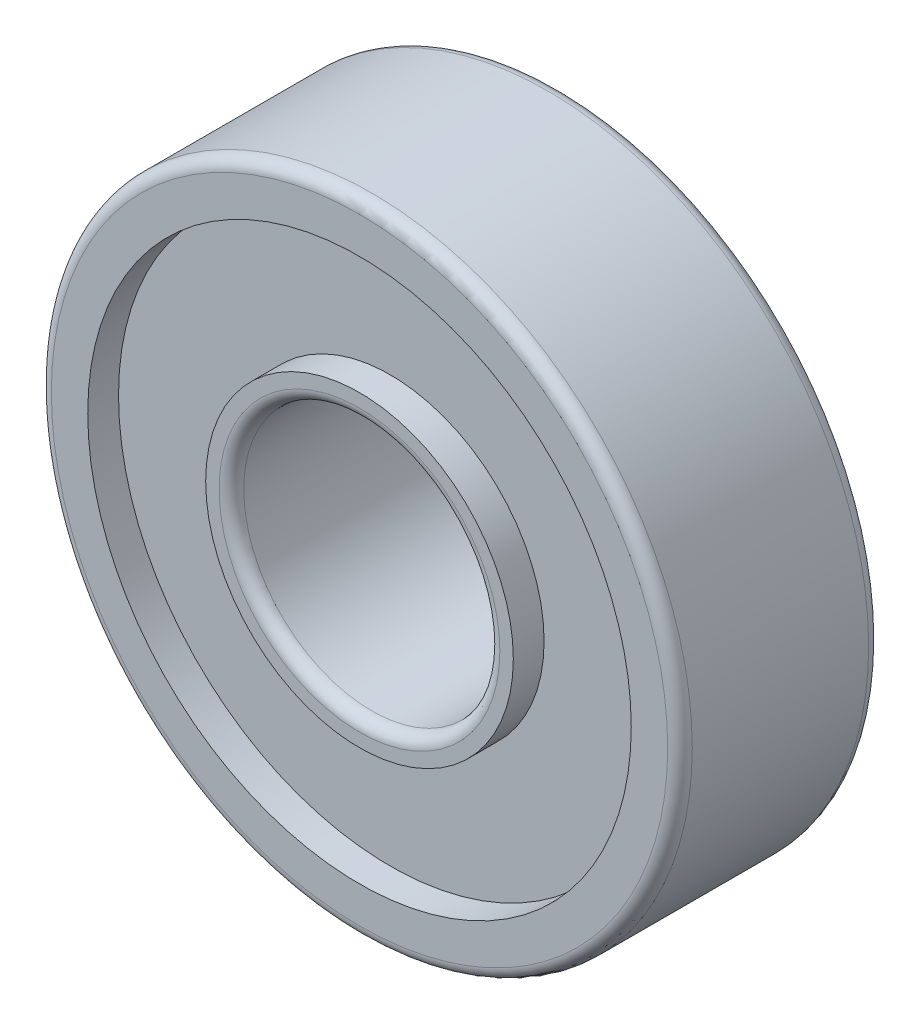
ISO-10303-21;
HEADER;
FILE_DESCRIPTION(('STEP AP214'),'2;1');
FILE_NAME('part.step','',(''),(''),'','','');
FILE_SCHEMA(('AUTOMOTIVE_DESIGN { 1 0 10303 214 1 1 1 1 }'));
ENDSEC;
DATA;
#1=APPLICATION_CONTEXT('core data for automotive mechanical design processes');
#2=APPLICATION_PROTOCOL_DEFINITION('international standard','automotive_design',2000,#1);
#3=PRODUCT_CONTEXT('',#1,'mechanical');
#4=PRODUCT('Part','Part','',(#3));
#5=PRODUCT_RELATED_PRODUCT_CATEGORY('part','',(#4));
#6=PRODUCT_DEFINITION_FORMATION('','',#4);
#7=PRODUCT_DEFINITION_CONTEXT('part definition',#1,'design');
#8=PRODUCT_DEFINITION('design','',#6,#7);
#9=PRODUCT_DEFINITION_SHAPE('','',#8);
#10=(LENGTH_UNIT() NAMED_UNIT(*) SI_UNIT(.MILLI.,.METRE.));
#11=(NAMED_UNIT(*) PLANE_ANGLE_UNIT() SI_UNIT($,.RADIAN.));
#12=(NAMED_UNIT(*) SI_UNIT($,.STERADIAN.) SOLID_ANGLE_UNIT());
#13=UNCERTAINTY_MEASURE_WITH_UNIT(LENGTH_MEASURE(1.E-05),#10,'distance_accuracy_value','');
#14=(GEOMETRIC_REPRESENTATION_CONTEXT(3) GLOBAL_UNCERTAINTY_ASSIGNED_CONTEXT((#13)) GLOBAL_UNIT_ASSIGNED_CONTEXT((#10,
#11,#12)) REPRESENTATION_CONTEXT('',''));
#15=CARTESIAN_POINT('',(0.,0.,0.));
#16=DIRECTION('',(0.,0.,1.));
#17=DIRECTION('',(1.,0.,0.));
#18=AXIS2_PLACEMENT_3D('',#15,#16,#17);
#19=CARTESIAN_POINT('',(0.,0.,-4.9784));
#20=DIRECTION('',(0.,0.,1.));
#21=DIRECTION('',(1.,0.,0.));
#22=AXIS2_PLACEMENT_3D('',#19,#20,#21);
#23=PLANE('',#22);
#24=CARTESIAN_POINT('',(0.,0.,-4.9784));
#25=DIRECTION('',(0.,0.,1.));
#26=DIRECTION('',(1.,0.,0.));
#27=AXIS2_PLACEMENT_3D('',#24,#25,#26);
#28=CIRCLE('',#27,3.47726);
#29=CARTESIAN_POINT('',(3.47726,0.,-4.9784));
#30=VERTEX_POINT('',#29);
#31=EDGE_CURVE('E60',#30,#30,#28,.T.);
#32=ORIENTED_EDGE('',*,*,#31,.T.);
#33=EDGE_LOOP('',(#32));
#34=FACE_BOUND('',#33,.T.);
#35=CARTESIAN_POINT('',(0.,0.,-4.9784));
#36=DIRECTION('',(0.,0.,-1.));
#37=DIRECTION('',(-1.,0.,0.));
#38=AXIS2_PLACEMENT_3D('',#35,#36,#37);
#39=CIRCLE('',#38,3.81);
#40=CARTESIAN_POINT('',(-3.81,0.,-4.9784));
#41=VERTEX_POINT('',#40);
#42=EDGE_CURVE('E82',#41,#41,#39,.T.);
#43=ORIENTED_EDGE('',*,*,#42,.T.);
#44=EDGE_LOOP('',(#43));
#45=FACE_BOUND('',#44,.T.);
#46=ADVANCED_FACE('F31',(#34,#45),#23,.F.);
#47=CARTESIAN_POINT('',(0.,0.,0.));
#48=DIRECTION('',(0.,0.,1.));
#49=DIRECTION('',(1.,0.,0.));
#50=AXIS2_PLACEMENT_3D('',#47,#48,#49);
#51=PLANE('',#50);
#52=CARTESIAN_POINT('',(0.,0.,0.));
#53=DIRECTION('',(0.,0.,1.));
#54=DIRECTION('',(1.,0.,0.));
#55=AXIS2_PLACEMENT_3D('',#52,#53,#54);
#56=CIRCLE('',#55,3.47726);
#57=CARTESIAN_POINT('',(3.47726,0.,0.));
#58=VERTEX_POINT('',#57);
#59=EDGE_CURVE('E51',#58,#58,#56,.F.);
#60=ORIENTED_EDGE('',*,*,#59,.T.);
#61=EDGE_LOOP('',(#60));
#62=FACE_BOUND('',#61,.T.);
#63=CARTESIAN_POINT('',(0.,0.,0.));
#64=DIRECTION('',(0.,0.,1.));
#65=DIRECTION('',(1.,0.,0.));
#66=AXIS2_PLACEMENT_3D('',#63,#64,#65);
#67=CIRCLE('',#66,3.81);
#68=CARTESIAN_POINT('',(3.81,0.,0.));
#69=VERTEX_POINT('',#68);
#70=EDGE_CURVE('E70',#69,#69,#67,.T.);
#71=ORIENTED_EDGE('',*,*,#70,.T.);
#72=EDGE_LOOP('',(#71));
#73=FACE_BOUND('',#72,.T.);
#74=ADVANCED_FACE('F115',(#62,#73),#51,.T.);
#75=CARTESIAN_POINT('',(0.,0.,-4.9784));
#76=DIRECTION('',(0.,0.,1.));
#77=DIRECTION('',(1.,0.,0.));
#78=AXIS2_PLACEMENT_3D('',#75,#76,#77);
#79=CYLINDRICAL_SURFACE('',#78,7.9375);
#80=CARTESIAN_POINT('',(0.,0.,-4.6736));
#81=DIRECTION('',(0.,0.,1.));
#82=DIRECTION('',(1.,0.,0.));
#83=AXIS2_PLACEMENT_3D('',#80,#81,#82);
#84=CIRCLE('',#83,7.9375);
#85=CARTESIAN_POINT('',(7.9375,0.,-4.6736));
#86=VERTEX_POINT('',#85);
#87=EDGE_CURVE('E42',#86,#86,#84,.T.);
#88=ORIENTED_EDGE('',*,*,#87,.T.);
#89=EDGE_LOOP('',(#88));
#90=FACE_BOUND('',#89,.T.);
#91=CARTESIAN_POINT('',(0.,0.,-0.3048));
#92=DIRECTION('',(0.,0.,1.));
#93=DIRECTION('',(1.,0.,0.));
#94=AXIS2_PLACEMENT_3D('',#91,#92,#93);
#95=CIRCLE('',#94,7.9375);
#96=CARTESIAN_POINT('',(7.9375,0.,-0.3048));
#97=VERTEX_POINT('',#96);
#98=EDGE_CURVE('E46',#97,#97,#95,.F.);
#99=ORIENTED_EDGE('',*,*,#98,.T.);
#100=EDGE_LOOP('',(#99));
#101=FACE_BOUND('',#100,.T.);
#102=ADVANCED_FACE('F107',(#90,#101),#79,.T.);
#103=CARTESIAN_POINT('',(0.,0.,-4.9784));
#104=DIRECTION('',(0.,0.,1.));
#105=DIRECTION('',(1.,0.,0.));
#106=AXIS2_PLACEMENT_3D('',#103,#104,#105);
#107=CIRCLE('',#106,7.6327);
#108=CARTESIAN_POINT('',(7.6327,0.,-4.9784));
#109=VERTEX_POINT('',#108);
#110=EDGE_CURVE('E38',#109,#109,#107,.F.);
#111=ORIENTED_EDGE('',*,*,#110,.T.);
#112=EDGE_LOOP('',(#111));
#113=FACE_BOUND('',#112,.T.);
#114=CARTESIAN_POINT('',(0.,0.,-4.9784));
#115=DIRECTION('',(0.,0.,-1.));
#116=DIRECTION('',(-1.,0.,0.));
#117=AXIS2_PLACEMENT_3D('',#114,#115,#116);
#118=CIRCLE('',#117,6.731);
#119=CARTESIAN_POINT('',(-6.731,0.,-4.9784));
#120=VERTEX_POINT('',#119);
#121=EDGE_CURVE('E76',#120,#120,#118,.T.);
#122=ORIENTED_EDGE('',*,*,#121,.F.);
#123=EDGE_LOOP('',(#122));
#124=FACE_BOUND('',#123,.T.);
#125=ADVANCED_FACE('F104',(#113,#124),#23,.F.);
#126=CARTESIAN_POINT('',(0.,0.,0.));
#127=DIRECTION('',(0.,0.,1.));
#128=DIRECTION('',(1.,0.,0.));
#129=AXIS2_PLACEMENT_3D('',#126,#127,#128);
#130=CIRCLE('',#129,7.6327);
#131=CARTESIAN_POINT('',(7.6327,0.,0.));
#132=VERTEX_POINT('',#131);
#133=EDGE_CURVE('E10',#132,#132,#130,.T.);
#134=ORIENTED_EDGE('',*,*,#133,.T.);
#135=EDGE_LOOP('',(#134));
#136=FACE_BOUND('',#135,.T.);
#137=CARTESIAN_POINT('',(0.,0.,0.));
#138=DIRECTION('',(0.,0.,1.));
#139=DIRECTION('',(1.,0.,0.));
#140=AXIS2_PLACEMENT_3D('',#137,#138,#139);
#141=CIRCLE('',#140,6.731);
#142=CARTESIAN_POINT('',(6.731,0.,0.));
#143=VERTEX_POINT('',#142);
#144=EDGE_CURVE('E64',#143,#143,#141,.T.);
#145=ORIENTED_EDGE('',*,*,#144,.F.);
#146=EDGE_LOOP('',(#145));
#147=FACE_BOUND('',#146,.T.);
#148=ADVANCED_FACE('F106',(#136,#147),#51,.T.);
#149=CARTESIAN_POINT('',(0.,0.,-4.9784));
#150=DIRECTION('',(0.,0.,1.));
#151=DIRECTION('',(1.,0.,0.));
#152=AXIS2_PLACEMENT_3D('',#149,#150,#151);
#153=CYLINDRICAL_SURFACE('',#152,3.17246);
#154=CARTESIAN_POINT('',(0.,0.,-4.6736));
#155=DIRECTION('',(0.,0.,1.));
#156=DIRECTION('',(1.,0.,0.));
#157=AXIS2_PLACEMENT_3D('',#154,#155,#156);
#158=CIRCLE('',#157,3.17246);
#159=CARTESIAN_POINT('',(3.17246,0.,-4.6736));
#160=VERTEX_POINT('',#159);
#161=EDGE_CURVE('E54',#160,#160,#158,.F.);
#162=ORIENTED_EDGE('',*,*,#161,.T.);
#163=EDGE_LOOP('',(#162));
#164=FACE_BOUND('',#163,.T.);
#165=CARTESIAN_POINT('',(0.,0.,-0.3048));
#166=DIRECTION('',(0.,0.,1.));
#167=DIRECTION('',(1.,0.,0.));
#168=AXIS2_PLACEMENT_3D('',#165,#166,#167);
#169=CIRCLE('',#168,3.17246);
#170=CARTESIAN_POINT('',(3.17246,0.,-0.3048));
#171=VERTEX_POINT('',#170);
#172=EDGE_CURVE('E57',#171,#171,#169,.T.);
#173=ORIENTED_EDGE('',*,*,#172,.T.);
#174=EDGE_LOOP('',(#173));
#175=FACE_BOUND('',#174,.T.);
#176=ADVANCED_FACE('F113',(#164,#175),#153,.F.);
#177=CARTESIAN_POINT('',(0.,0.,-0.762));
#178=DIRECTION('',(0.,0.,1.));
#179=DIRECTION('',(1.,0.,0.));
#180=AXIS2_PLACEMENT_3D('',#177,#178,#179);
#181=CYLINDRICAL_SURFACE('',#180,6.731);
#182=CARTESIAN_POINT('',(0.,0.,-0.762));
#183=DIRECTION('',(0.,0.,1.));
#184=DIRECTION('',(1.,0.,0.));
#185=AXIS2_PLACEMENT_3D('',#182,#183,#184);
#186=CIRCLE('',#185,6.731);
#187=CARTESIAN_POINT('',(6.731,0.,-0.762));
#188=VERTEX_POINT('',#187);
#189=EDGE_CURVE('E63',#188,#188,#186,.T.);
#190=CARTESIAN_POINT('',(6.731,0.,-0.762));
#191=CARTESIAN_POINT('',(6.731,0.,-0.7540625));
#192=CARTESIAN_POINT('',(6.731,0.,-0.746125));
#193=CARTESIAN_POINT('',(6.731,0.,-0.73025));
#194=CARTESIAN_POINT('',(6.731,0.,-0.7223125));
#195=CARTESIAN_POINT('',(6.731,0.,-0.7064375));
#196=CARTESIAN_POINT('',(6.731,0.,-0.6985));
#197=CARTESIAN_POINT('',(6.731,0.,-0.682625));
#198=CARTESIAN_POINT('',(6.731,0.,-0.6746875));
#199=CARTESIAN_POINT('',(6.731,0.,-0.6588125));
#200=CARTESIAN_POINT('',(6.731,0.,-0.650875));
#201=CARTESIAN_POINT('',(6.731,0.,-0.635));
#202=CARTESIAN_POINT('',(6.731,0.,-0.6270625));
#203=CARTESIAN_POINT('',(6.731,0.,-0.6111875));
#204=CARTESIAN_POINT('',(6.731,0.,-0.60325));
#205=CARTESIAN_POINT('',(6.731,0.,-0.587375));
#206=CARTESIAN_POINT('',(6.731,0.,-0.5794375));
#207=CARTESIAN_POINT('',(6.731,0.,-0.5635625));
#208=CARTESIAN_POINT('',(6.731,0.,-0.555625));
#209=CARTESIAN_POINT('',(6.731,0.,-0.53975));
#210=CARTESIAN_POINT('',(6.731,0.,-0.5318125));
#211=CARTESIAN_POINT('',(6.731,0.,-0.5159375));
#212=CARTESIAN_POINT('',(6.731,0.,-0.508));
#213=CARTESIAN_POINT('',(6.731,0.,-0.492125));
#214=CARTESIAN_POINT('',(6.731,0.,-0.4841875));
#215=CARTESIAN_POINT('',(6.731,0.,-0.4683125));
#216=CARTESIAN_POINT('',(6.731,0.,-0.460375));
#217=CARTESIAN_POINT('',(6.731,0.,-0.4445));
#218=CARTESIAN_POINT('',(6.731,0.,-0.4365625));
#219=CARTESIAN_POINT('',(6.731,0.,-0.4206875));
#220=CARTESIAN_POINT('',(6.731,0.,-0.41275));
#221=CARTESIAN_POINT('',(6.731,0.,-0.396875));
#222=CARTESIAN_POINT('',(6.731,0.,-0.3889375));
#223=CARTESIAN_POINT('',(6.731,0.,-0.3730625));
#224=CARTESIAN_POINT('',(6.731,0.,-0.365125));
#225=CARTESIAN_POINT('',(6.731,0.,-0.34925));
#226=CARTESIAN_POINT('',(6.731,0.,-0.3413125));
#227=CARTESIAN_POINT('',(6.731,0.,-0.3254375));
#228=CARTESIAN_POINT('',(6.731,0.,-0.3175));
#229=CARTESIAN_POINT('',(6.731,0.,-0.301625));
#230=CARTESIAN_POINT('',(6.731,0.,-0.2936875));
#231=CARTESIAN_POINT('',(6.731,0.,-0.2778125));
#232=CARTESIAN_POINT('',(6.731,0.,-0.269875));
#233=CARTESIAN_POINT('',(6.731,0.,-0.254));
#234=CARTESIAN_POINT('',(6.731,0.,-0.2460625));
#235=CARTESIAN_POINT('',(6.731,0.,-0.2301875));
#236=CARTESIAN_POINT('',(6.731,0.,-0.22225));
#237=CARTESIAN_POINT('',(6.731,0.,-0.206375));
#238=CARTESIAN_POINT('',(6.731,0.,-0.1984375));
#239=CARTESIAN_POINT('',(6.731,0.,-0.1825625));
#240=CARTESIAN_POINT('',(6.731,0.,-0.174625));
#241=CARTESIAN_POINT('',(6.731,0.,-0.15875));
#242=CARTESIAN_POINT('',(6.731,0.,-0.1508125));
#243=CARTESIAN_POINT('',(6.731,0.,-0.1349375));
#244=CARTESIAN_POINT('',(6.731,0.,-0.127));
#245=CARTESIAN_POINT('',(6.731,0.,-0.111125));
#246=CARTESIAN_POINT('',(6.731,0.,-0.1031875));
#247=CARTESIAN_POINT('',(6.731,0.,-0.0873125));
#248=CARTESIAN_POINT('',(6.731,0.,-0.079375));
#249=CARTESIAN_POINT('',(6.731,0.,-0.0635));
#250=CARTESIAN_POINT('',(6.731,0.,-0.0555625));
#251=CARTESIAN_POINT('',(6.731,0.,-0.0396875));
#252=CARTESIAN_POINT('',(6.731,0.,-0.03175));
#253=CARTESIAN_POINT('',(6.731,0.,-0.015875));
#254=CARTESIAN_POINT('',(6.731,0.,-0.00793749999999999));
#255=CARTESIAN_POINT('',(6.731,0.,0.));
#256=B_SPLINE_CURVE_WITH_KNOTS('',3,(#190,#191,#192,#193,#194,#195,#196,#197,#198,#199,#200,
#201,#202,#203,#204,#205,#206,#207,#208,#209,#210,#211,#212,#213,#214,#215,#216,#217,#218,#219,
#220,#221,#222,#223,#224,#225,#226,#227,#228,#229,#230,#231,#232,#233,#234,#235,#236,#237,#238,
#239,#240,#241,#242,#243,#244,#245,#246,#247,#248,#249,#250,#251,#252,#253,#254,#255),
.UNSPECIFIED.,.F.,.F.,(4,2,2,2,2,2,2,2,2,2,2,2,2,2,2,2,2,2,2,2,2,2,2,2,2,2,2,2,2,2,2,2,4),(0.,
0.0238125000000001,0.047625,0.0714375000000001,0.0952500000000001,0.1190625,0.142875,0.1666875,
0.1905,0.2143125,0.238125,0.2619375,0.28575,0.3095625,0.333375,0.3571875,0.381,0.4048125,
0.428625,0.4524375,0.47625,0.5000625,0.523875,0.5476875,0.5715,0.5953125,0.619125,0.6429375,
0.66675,0.6905625,0.714375,0.7381875,0.762),.UNSPECIFIED.);
#257=EDGE_CURVE('BSEAM144',#188,#143,#256,.T.);
#258=ORIENTED_EDGE('',*,*,#189,.F.);
#259=ORIENTED_EDGE('',*,*,#144,.T.);
#260=ORIENTED_EDGE('',*,*,#257,.T.);
#261=ORIENTED_EDGE('',*,*,#257,.F.);
#262=EDGE_LOOP('',(#258,#260,#259,#261));
#263=FACE_BOUND('',#262,.T.);
#264=ADVANCED_FACE('F144',(#263),#181,.F.);
#265=CARTESIAN_POINT('',(0.,0.,-0.762));
#266=DIRECTION('',(0.,0.,1.));
#267=DIRECTION('',(1.,0.,0.));
#268=AXIS2_PLACEMENT_3D('',#265,#266,#267);
#269=PLANE('',#268);
#270=CARTESIAN_POINT('',(0.,0.,-0.762));
#271=DIRECTION('',(0.,0.,1.));
#272=DIRECTION('',(1.,0.,0.));
#273=AXIS2_PLACEMENT_3D('',#270,#271,#272);
#274=CIRCLE('',#273,3.81);
#275=CARTESIAN_POINT('',(3.81,0.,-0.762));
#276=VERTEX_POINT('',#275);
#277=EDGE_CURVE('E67',#276,#276,#274,.T.);
#278=ORIENTED_EDGE('',*,*,#277,.F.);
#279=EDGE_LOOP('',(#278));
#280=FACE_BOUND('',#279,.T.);
#281=ORIENTED_EDGE('',*,*,#189,.T.);
#282=EDGE_LOOP('',(#281));
#283=FACE_BOUND('',#282,.T.);
#284=ADVANCED_FACE('F140',(#280,#283),#269,.T.);
#285=CARTESIAN_POINT('',(0.,0.,-0.762));
#286=DIRECTION('',(0.,0.,1.));
#287=DIRECTION('',(1.,0.,0.));
#288=AXIS2_PLACEMENT_3D('',#285,#286,#287);
#289=CYLINDRICAL_SURFACE('',#288,3.81);
#290=CARTESIAN_POINT('',(3.81,0.,-0.762));
#291=CARTESIAN_POINT('',(3.81,0.,-0.7540625));
#292=CARTESIAN_POINT('',(3.81,0.,-0.746125));
#293=CARTESIAN_POINT('',(3.81,0.,-0.73025));
#294=CARTESIAN_POINT('',(3.81,0.,-0.7223125));
#295=CARTESIAN_POINT('',(3.81,0.,-0.7064375));
#296=CARTESIAN_POINT('',(3.81,0.,-0.6985));
#297=CARTESIAN_POINT('',(3.81,0.,-0.682625));
#298=CARTESIAN_POINT('',(3.81,0.,-0.6746875));
#299=CARTESIAN_POINT('',(3.81,0.,-0.6588125));
#300=CARTESIAN_POINT('',(3.81,0.,-0.650875));
#301=CARTESIAN_POINT('',(3.81,0.,-0.635));
#302=CARTESIAN_POINT('',(3.81,0.,-0.6270625));
#303=CARTESIAN_POINT('',(3.81,0.,-0.6111875));
#304=CARTESIAN_POINT('',(3.81,0.,-0.60325));
#305=CARTESIAN_POINT('',(3.81,0.,-0.587375));
#306=CARTESIAN_POINT('',(3.81,0.,-0.5794375));
#307=CARTESIAN_POINT('',(3.81,0.,-0.5635625));
#308=CARTESIAN_POINT('',(3.81,0.,-0.555625));
#309=CARTESIAN_POINT('',(3.81,0.,-0.53975));
#310=CARTESIAN_POINT('',(3.81,0.,-0.5318125));
#311=CARTESIAN_POINT('',(3.81,0.,-0.5159375));
#312=CARTESIAN_POINT('',(3.81,0.,-0.508));
#313=CARTESIAN_POINT('',(3.81,0.,-0.492125));
#314=CARTESIAN_POINT('',(3.81,0.,-0.4841875));
#315=CARTESIAN_POINT('',(3.81,0.,-0.4683125));
#316=CARTESIAN_POINT('',(3.81,0.,-0.460375));
#317=CARTESIAN_POINT('',(3.81,0.,-0.4445));
#318=CARTESIAN_POINT('',(3.81,0.,-0.4365625));
#319=CARTESIAN_POINT('',(3.81,0.,-0.4206875));
#320=CARTESIAN_POINT('',(3.81,0.,-0.41275));
#321=CARTESIAN_POINT('',(3.81,0.,-0.396875));
#322=CARTESIAN_POINT('',(3.81,0.,-0.3889375));
#323=CARTESIAN_POINT('',(3.81,0.,-0.3730625));
#324=CARTESIAN_POINT('',(3.81,0.,-0.365125));
#325=CARTESIAN_POINT('',(3.81,0.,-0.34925));
#326=CARTESIAN_POINT('',(3.81,0.,-0.3413125));
#327=CARTESIAN_POINT('',(3.81,0.,-0.3254375));
#328=CARTESIAN_POINT('',(3.81,0.,-0.3175));
#329=CARTESIAN_POINT('',(3.81,0.,-0.301625));
#330=CARTESIAN_POINT('',(3.81,0.,-0.2936875));
#331=CARTESIAN_POINT('',(3.81,0.,-0.2778125));
#332=CARTESIAN_POINT('',(3.81,0.,-0.269875));
#333=CARTESIAN_POINT('',(3.81,0.,-0.254));
#334=CARTESIAN_POINT('',(3.81,0.,-0.2460625));
#335=CARTESIAN_POINT('',(3.81,0.,-0.2301875));
#336=CARTESIAN_POINT('',(3.81,0.,-0.22225));
#337=CARTESIAN_POINT('',(3.81,0.,-0.206375));
#338=CARTESIAN_POINT('',(3.81,0.,-0.1984375));
#339=CARTESIAN_POINT('',(3.81,0.,-0.1825625));
#340=CARTESIAN_POINT('',(3.81,0.,-0.174625));
#341=CARTESIAN_POINT('',(3.81,0.,-0.15875));
#342=CARTESIAN_POINT('',(3.81,0.,-0.1508125));
#343=CARTESIAN_POINT('',(3.81,0.,-0.1349375));
#344=CARTESIAN_POINT('',(3.81,0.,-0.127));
#345=CARTESIAN_POINT('',(3.81,0.,-0.111125));
#346=CARTESIAN_POINT('',(3.81,0.,-0.1031875));
#347=CARTESIAN_POINT('',(3.81,0.,-0.0873125));
#348=CARTESIAN_POINT('',(3.81,0.,-0.079375));
#349=CARTESIAN_POINT('',(3.81,0.,-0.0635));
#350=CARTESIAN_POINT('',(3.81,0.,-0.0555625));
#351=CARTESIAN_POINT('',(3.81,0.,-0.0396875));
#352=CARTESIAN_POINT('',(3.81,0.,-0.03175));
#353=CARTESIAN_POINT('',(3.81,0.,-0.015875));
#354=CARTESIAN_POINT('',(3.81,0.,-0.00793749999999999));
#355=CARTESIAN_POINT('',(3.81,0.,0.));
#356=B_SPLINE_CURVE_WITH_KNOTS('',3,(#290,#291,#292,#293,#294,#295,#296,#297,#298,#299,#300,
#301,#302,#303,#304,#305,#306,#307,#308,#309,#310,#311,#312,#313,#314,#315,#316,#317,#318,#319,
#320,#321,#322,#323,#324,#325,#326,#327,#328,#329,#330,#331,#332,#333,#334,#335,#336,#337,#338,
#339,#340,#341,#342,#343,#344,#345,#346,#347,#348,#349,#350,#351,#352,#353,#354,#355),
.UNSPECIFIED.,.F.,.F.,(4,2,2,2,2,2,2,2,2,2,2,2,2,2,2,2,2,2,2,2,2,2,2,2,2,2,2,2,2,2,2,2,4),(0.,
0.0238125,0.0476249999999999,0.0714375,0.09525,0.1190625,0.142875,0.1666875,0.1905,0.2143125,
0.238125,0.2619375,0.28575,0.3095625,0.333375,0.3571875,0.381,0.4048125,0.428625,0.4524375,
0.47625,0.5000625,0.523875,0.5476875,0.5715,0.5953125,0.619125,0.6429375,0.66675,0.6905625,
0.714375,0.7381875,0.762),.UNSPECIFIED.);
#357=EDGE_CURVE('BSEAM100',#276,#69,#356,.T.);
#358=ORIENTED_EDGE('',*,*,#277,.T.);
#359=ORIENTED_EDGE('',*,*,#70,.F.);
#360=ORIENTED_EDGE('',*,*,#357,.T.);
#361=ORIENTED_EDGE('',*,*,#357,.F.);
#362=EDGE_LOOP('',(#358,#360,#359,#361));
#363=FACE_BOUND('',#362,.T.);
#364=ADVANCED_FACE('F100',(#363),#289,.T.);
#365=CARTESIAN_POINT('',(0.,0.,-4.2164));
#366=DIRECTION('',(0.,0.,-1.));
#367=DIRECTION('',(-1.,0.,0.));
#368=AXIS2_PLACEMENT_3D('',#365,#366,#367);
#369=CYLINDRICAL_SURFACE('',#368,6.731);
#370=CARTESIAN_POINT('',(0.,0.,-4.2164));
#371=DIRECTION('',(0.,0.,-1.));
#372=DIRECTION('',(-1.,0.,0.));
#373=AXIS2_PLACEMENT_3D('',#370,#371,#372);
#374=CIRCLE('',#373,6.731);
#375=CARTESIAN_POINT('',(-6.731,0.,-4.2164));
#376=VERTEX_POINT('',#375);
#377=EDGE_CURVE('E73',#376,#376,#374,.T.);
#378=CARTESIAN_POINT('',(-6.731,0.,-4.2164));
#379=CARTESIAN_POINT('',(-6.731,0.,-4.2243375));
#380=CARTESIAN_POINT('',(-6.731,0.,-4.232275));
#381=CARTESIAN_POINT('',(-6.731,0.,-4.24815));
#382=CARTESIAN_POINT('',(-6.731,0.,-4.2560875));
#383=CARTESIAN_POINT('',(-6.731,0.,-4.2719625));
#384=CARTESIAN_POINT('',(-6.731,0.,-4.2799));
#385=CARTESIAN_POINT('',(-6.731,0.,-4.295775));
#386=CARTESIAN_POINT('',(-6.731,0.,-4.3037125));
#387=CARTESIAN_POINT('',(-6.731,0.,-4.3195875));
#388=CARTESIAN_POINT('',(-6.731,0.,-4.327525));
#389=CARTESIAN_POINT('',(-6.731,0.,-4.3434));
#390=CARTESIAN_POINT('',(-6.731,0.,-4.3513375));
#391=CARTESIAN_POINT('',(-6.731,0.,-4.3672125));
#392=CARTESIAN_POINT('',(-6.731,0.,-4.37515));
#393=CARTESIAN_POINT('',(-6.731,0.,-4.391025));
#394=CARTESIAN_POINT('',(-6.731,0.,-4.3989625));
#395=CARTESIAN_POINT('',(-6.731,0.,-4.4148375));
#396=CARTESIAN_POINT('',(-6.731,0.,-4.422775));
#397=CARTESIAN_POINT('',(-6.731,0.,-4.43865));
#398=CARTESIAN_POINT('',(-6.731,0.,-4.4465875));
#399=CARTESIAN_POINT('',(-6.731,0.,-4.4624625));
#400=CARTESIAN_POINT('',(-6.731,0.,-4.4704));
#401=CARTESIAN_POINT('',(-6.731,0.,-4.486275));
#402=CARTESIAN_POINT('',(-6.731,0.,-4.4942125));
#403=CARTESIAN_POINT('',(-6.731,0.,-4.5100875));
#404=CARTESIAN_POINT('',(-6.731,0.,-4.518025));
#405=CARTESIAN_POINT('',(-6.731,0.,-4.5339));
#406=CARTESIAN_POINT('',(-6.731,0.,-4.5418375));
#407=CARTESIAN_POINT('',(-6.731,0.,-4.5577125));
#408=CARTESIAN_POINT('',(-6.731,0.,-4.56565));
#409=CARTESIAN_POINT('',(-6.731,0.,-4.581525));
#410=CARTESIAN_POINT('',(-6.731,0.,-4.5894625));
#411=CARTESIAN_POINT('',(-6.731,0.,-4.6053375));
#412=CARTESIAN_POINT('',(-6.731,0.,-4.613275));
#413=CARTESIAN_POINT('',(-6.731,0.,-4.62915));
#414=CARTESIAN_POINT('',(-6.731,0.,-4.6370875));
#415=CARTESIAN_POINT('',(-6.731,0.,-4.6529625));
#416=CARTESIAN_POINT('',(-6.731,0.,-4.6609));
#417=CARTESIAN_POINT('',(-6.731,0.,-4.676775));
#418=CARTESIAN_POINT('',(-6.731,0.,-4.6847125));
#419=CARTESIAN_POINT('',(-6.731,0.,-4.7005875));
#420=CARTESIAN_POINT('',(-6.731,0.,-4.708525));
#421=CARTESIAN_POINT('',(-6.731,0.,-4.7244));
#422=CARTESIAN_POINT('',(-6.731,0.,-4.7323375));
#423=CARTESIAN_POINT('',(-6.731,0.,-4.7482125));
#424=CARTESIAN_POINT('',(-6.731,0.,-4.75615));
#425=CARTESIAN_POINT('',(-6.731,0.,-4.772025));
#426=CARTESIAN_POINT('',(-6.731,0.,-4.7799625));
#427=CARTESIAN_POINT('',(-6.731,0.,-4.7958375));
#428=CARTESIAN_POINT('',(-6.731,0.,-4.803775));
#429=CARTESIAN_POINT('',(-6.731,0.,-4.81965));
#430=CARTESIAN_POINT('',(-6.731,0.,-4.8275875));
#431=CARTESIAN_POINT('',(-6.731,0.,-4.8434625));
#432=CARTESIAN_POINT('',(-6.731,0.,-4.8514));
#433=CARTESIAN_POINT('',(-6.731,0.,-4.867275));
#434=CARTESIAN_POINT('',(-6.731,0.,-4.8752125));
#435=CARTESIAN_POINT('',(-6.731,0.,-4.8910875));
#436=CARTESIAN_POINT('',(-6.731,0.,-4.899025));
#437=CARTESIAN_POINT('',(-6.731,0.,-4.9149));
#438=CARTESIAN_POINT('',(-6.731,0.,-4.9228375));
#439=CARTESIAN_POINT('',(-6.731,0.,-4.9387125));
#440=CARTESIAN_POINT('',(-6.731,0.,-4.94665));
#441=CARTESIAN_POINT('',(-6.731,0.,-4.962525));
#442=CARTESIAN_POINT('',(-6.731,0.,-4.9704625));
#443=CARTESIAN_POINT('',(-6.731,0.,-4.9784));
#444=B_SPLINE_CURVE_WITH_KNOTS('',3,(#378,#379,#380,#381,#382,#383,#384,#385,#386,#387,#388,
#389,#390,#391,#392,#393,#394,#395,#396,#397,#398,#399,#400,#401,#402,#403,#404,#405,#406,#407,
#408,#409,#410,#411,#412,#413,#414,#415,#416,#417,#418,#419,#420,#421,#422,#423,#424,#425,#426,
#427,#428,#429,#430,#431,#432,#433,#434,#435,#436,#437,#438,#439,#440,#441,#442,#443),
.UNSPECIFIED.,.F.,.F.,(4,2,2,2,2,2,2,2,2,2,2,2,2,2,2,2,2,2,2,2,2,2,2,2,2,2,2,2,2,2,2,2,4),(0.,
0.0238124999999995,0.0476249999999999,0.0714374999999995,0.0952499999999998,0.119062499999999,
0.142875,0.166687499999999,0.1905,0.214312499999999,0.238125,0.261937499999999,0.28575,
0.309562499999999,0.333374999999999,0.3571875,0.380999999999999,0.4048125,0.428624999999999,
0.4524375,0.476249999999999,0.5000625,0.523874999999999,0.5476875,0.571499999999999,
0.595312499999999,0.619124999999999,0.642937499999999,0.666749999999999,0.690562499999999,
0.714375,0.738187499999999,0.762),.UNSPECIFIED.);
#445=EDGE_CURVE('BSEAM94',#376,#120,#444,.T.);
#446=ORIENTED_EDGE('',*,*,#377,.F.);
#447=ORIENTED_EDGE('',*,*,#121,.T.);
#448=ORIENTED_EDGE('',*,*,#445,.T.);
#449=ORIENTED_EDGE('',*,*,#445,.F.);
#450=EDGE_LOOP('',(#446,#448,#447,#449));
#451=FACE_BOUND('',#450,.T.);
#452=ADVANCED_FACE('F94',(#451),#369,.F.);
#453=CARTESIAN_POINT('',(0.,0.,-4.2164));
#454=DIRECTION('',(0.,0.,-1.));
#455=DIRECTION('',(-1.,0.,0.));
#456=AXIS2_PLACEMENT_3D('',#453,#454,#455);
#457=PLANE('',#456);
#458=CARTESIAN_POINT('',(0.,0.,-4.2164));
#459=DIRECTION('',(0.,0.,-1.));
#460=DIRECTION('',(-1.,0.,0.));
#461=AXIS2_PLACEMENT_3D('',#458,#459,#460);
#462=CIRCLE('',#461,3.81);
#463=CARTESIAN_POINT('',(-3.81,0.,-4.2164));
#464=VERTEX_POINT('',#463);
#465=EDGE_CURVE('E79',#464,#464,#462,.T.);
#466=ORIENTED_EDGE('',*,*,#465,.F.);
#467=EDGE_LOOP('',(#466));
#468=FACE_BOUND('',#467,.T.);
#469=ORIENTED_EDGE('',*,*,#377,.T.);
#470=EDGE_LOOP('',(#469));
#471=FACE_BOUND('',#470,.T.);
#472=ADVANCED_FACE('F91',(#468,#471),#457,.T.);
#473=CARTESIAN_POINT('',(0.,0.,-4.2164));
#474=DIRECTION('',(0.,0.,-1.));
#475=DIRECTION('',(-1.,0.,0.));
#476=AXIS2_PLACEMENT_3D('',#473,#474,#475);
#477=CYLINDRICAL_SURFACE('',#476,3.81);
#478=CARTESIAN_POINT('',(-3.81,0.,-4.2164));
#479=CARTESIAN_POINT('',(-3.81,0.,-4.2243375));
#480=CARTESIAN_POINT('',(-3.81,0.,-4.232275));
#481=CARTESIAN_POINT('',(-3.81,0.,-4.24815));
#482=CARTESIAN_POINT('',(-3.81,0.,-4.2560875));
#483=CARTESIAN_POINT('',(-3.81,0.,-4.2719625));
#484=CARTESIAN_POINT('',(-3.81,0.,-4.2799));
#485=CARTESIAN_POINT('',(-3.81,0.,-4.295775));
#486=CARTESIAN_POINT('',(-3.81,0.,-4.3037125));
#487=CARTESIAN_POINT('',(-3.81,0.,-4.3195875));
#488=CARTESIAN_POINT('',(-3.81,0.,-4.327525));
#489=CARTESIAN_POINT('',(-3.81,0.,-4.3434));
#490=CARTESIAN_POINT('',(-3.81,0.,-4.3513375));
#491=CARTESIAN_POINT('',(-3.81,0.,-4.3672125));
#492=CARTESIAN_POINT('',(-3.81,0.,-4.37515));
#493=CARTESIAN_POINT('',(-3.81,0.,-4.391025));
#494=CARTESIAN_POINT('',(-3.81,0.,-4.3989625));
#495=CARTESIAN_POINT('',(-3.81,0.,-4.4148375));
#496=CARTESIAN_POINT('',(-3.81,0.,-4.422775));
#497=CARTESIAN_POINT('',(-3.81,0.,-4.43865));
#498=CARTESIAN_POINT('',(-3.81,0.,-4.4465875));
#499=CARTESIAN_POINT('',(-3.81,0.,-4.4624625));
#500=CARTESIAN_POINT('',(-3.81,0.,-4.4704));
#501=CARTESIAN_POINT('',(-3.81,0.,-4.486275));
#502=CARTESIAN_POINT('',(-3.81,0.,-4.4942125));
#503=CARTESIAN_POINT('',(-3.81,0.,-4.5100875));
#504=CARTESIAN_POINT('',(-3.81,0.,-4.518025));
#505=CARTESIAN_POINT('',(-3.81,0.,-4.5339));
#506=CARTESIAN_POINT('',(-3.81,0.,-4.5418375));
#507=CARTESIAN_POINT('',(-3.81,0.,-4.5577125));
#508=CARTESIAN_POINT('',(-3.81,0.,-4.56565));
#509=CARTESIAN_POINT('',(-3.81,0.,-4.581525));
#510=CARTESIAN_POINT('',(-3.81,0.,-4.5894625));
#511=CARTESIAN_POINT('',(-3.81,0.,-4.6053375));
#512=CARTESIAN_POINT('',(-3.81,0.,-4.613275));
#513=CARTESIAN_POINT('',(-3.81,0.,-4.62915));
#514=CARTESIAN_POINT('',(-3.81,0.,-4.6370875));
#515=CARTESIAN_POINT('',(-3.81,0.,-4.6529625));
#516=CARTESIAN_POINT('',(-3.81,0.,-4.6609));
#517=CARTESIAN_POINT('',(-3.81,0.,-4.676775));
#518=CARTESIAN_POINT('',(-3.81,0.,-4.6847125));
#519=CARTESIAN_POINT('',(-3.81,0.,-4.7005875));
#520=CARTESIAN_POINT('',(-3.81,0.,-4.708525));
#521=CARTESIAN_POINT('',(-3.81,0.,-4.7244));
#522=CARTESIAN_POINT('',(-3.81,0.,-4.7323375));
#523=CARTESIAN_POINT('',(-3.81,0.,-4.7482125));
#524=CARTESIAN_POINT('',(-3.81,0.,-4.75615));
#525=CARTESIAN_POINT('',(-3.81,0.,-4.772025));
#526=CARTESIAN_POINT('',(-3.81,0.,-4.7799625));
#527=CARTESIAN_POINT('',(-3.81,0.,-4.7958375));
#528=CARTESIAN_POINT('',(-3.81,0.,-4.803775));
#529=CARTESIAN_POINT('',(-3.81,0.,-4.81965));
#530=CARTESIAN_POINT('',(-3.81,0.,-4.8275875));
#531=CARTESIAN_POINT('',(-3.81,0.,-4.8434625));
#532=CARTESIAN_POINT('',(-3.81,0.,-4.8514));
#533=CARTESIAN_POINT('',(-3.81,0.,-4.867275));
#534=CARTESIAN_POINT('',(-3.81,0.,-4.8752125));
#535=CARTESIAN_POINT('',(-3.81,0.,-4.8910875));
#536=CARTESIAN_POINT('',(-3.81,0.,-4.899025));
#537=CARTESIAN_POINT('',(-3.81,0.,-4.9149));
#538=CARTESIAN_POINT('',(-3.81,0.,-4.9228375));
#539=CARTESIAN_POINT('',(-3.81,0.,-4.9387125));
#540=CARTESIAN_POINT('',(-3.81,0.,-4.94665));
#541=CARTESIAN_POINT('',(-3.81,0.,-4.962525));
#542=CARTESIAN_POINT('',(-3.81,0.,-4.9704625));
#543=CARTESIAN_POINT('',(-3.81,0.,-4.9784));
#544=B_SPLINE_CURVE_WITH_KNOTS('',3,(#478,#479,#480,#481,#482,#483,#484,#485,#486,#487,#488,
#489,#490,#491,#492,#493,#494,#495,#496,#497,#498,#499,#500,#501,#502,#503,#504,#505,#506,#507,
#508,#509,#510,#511,#512,#513,#514,#515,#516,#517,#518,#519,#520,#521,#522,#523,#524,#525,#526,
#527,#528,#529,#530,#531,#532,#533,#534,#535,#536,#537,#538,#539,#540,#541,#542,#543),
.UNSPECIFIED.,.F.,.F.,(4,2,2,2,2,2,2,2,2,2,2,2,2,2,2,2,2,2,2,2,2,2,2,2,2,2,2,2,2,2,2,2,4),(0.,
0.0238124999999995,0.0476249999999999,0.0714374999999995,0.0952499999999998,0.119062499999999,
0.142875,0.166687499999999,0.1905,0.214312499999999,0.238125,0.261937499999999,0.28575,
0.309562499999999,0.333374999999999,0.3571875,0.380999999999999,0.4048125,0.428624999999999,
0.4524375,0.476249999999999,0.5000625,0.523874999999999,0.5476875,0.571499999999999,
0.595312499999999,0.619124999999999,0.642937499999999,0.666749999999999,0.690562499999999,
0.714375,0.738187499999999,0.762),.UNSPECIFIED.);
#545=EDGE_CURVE('BSEAM88',#464,#41,#544,.T.);
#546=ORIENTED_EDGE('',*,*,#465,.T.);
#547=ORIENTED_EDGE('',*,*,#42,.F.);
#548=ORIENTED_EDGE('',*,*,#545,.T.);
#549=ORIENTED_EDGE('',*,*,#545,.F.);
#550=EDGE_LOOP('',(#546,#548,#547,#549));
#551=FACE_BOUND('',#550,.T.);
#552=ADVANCED_FACE('F88',(#551),#477,.T.);
#553=CARTESIAN_POINT('',(0.,0.,-4.6736));
#554=DIRECTION('',(0.,0.,1.));
#555=DIRECTION('',(1.,0.,0.));
#556=AXIS2_PLACEMENT_3D('',#553,#554,#555);
#557=TOROIDAL_SURFACE('',#556,3.47726,0.3048);
#558=ORIENTED_EDGE('',*,*,#161,.F.);
#559=EDGE_LOOP('',(#558));
#560=FACE_BOUND('',#559,.T.);
#561=ORIENTED_EDGE('',*,*,#31,.F.);
#562=EDGE_LOOP('',(#561));
#563=FACE_BOUND('',#562,.T.);
#564=ADVANCED_FACE('F129',(#560,#563),#557,.T.);
#565=CARTESIAN_POINT('',(0.,0.,-0.3048));
#566=DIRECTION('',(0.,0.,1.));
#567=DIRECTION('',(1.,0.,0.));
#568=AXIS2_PLACEMENT_3D('',#565,#566,#567);
#569=TOROIDAL_SURFACE('',#568,3.47726,0.3048);
#570=ORIENTED_EDGE('',*,*,#59,.F.);
#571=EDGE_LOOP('',(#570));
#572=FACE_BOUND('',#571,.T.);
#573=ORIENTED_EDGE('',*,*,#172,.F.);
#574=EDGE_LOOP('',(#573));
#575=FACE_BOUND('',#574,.T.);
#576=ADVANCED_FACE('F134',(#572,#575),#569,.T.);
#577=CARTESIAN_POINT('',(0.,0.,-4.6736));
#578=DIRECTION('',(0.,0.,1.));
#579=DIRECTION('',(1.,0.,0.));
#580=AXIS2_PLACEMENT_3D('',#577,#578,#579);
#581=TOROIDAL_SURFACE('',#580,7.6327,0.3048);
#582=ORIENTED_EDGE('',*,*,#110,.F.);
#583=EDGE_LOOP('',(#582));
#584=FACE_BOUND('',#583,.T.);
#585=ORIENTED_EDGE('',*,*,#87,.F.);
#586=EDGE_LOOP('',(#585));
#587=FACE_BOUND('',#586,.T.);
#588=ADVANCED_FACE('F157',(#584,#587),#581,.T.);
#589=CARTESIAN_POINT('',(0.,0.,-0.3048));
#590=DIRECTION('',(0.,0.,1.));
#591=DIRECTION('',(1.,0.,0.));
#592=AXIS2_PLACEMENT_3D('',#589,#590,#591);
#593=TOROIDAL_SURFACE('',#592,7.6327,0.3048);
#594=ORIENTED_EDGE('',*,*,#98,.F.);
#595=EDGE_LOOP('',(#594));
#596=FACE_BOUND('',#595,.T.);
#597=ORIENTED_EDGE('',*,*,#133,.F.);
#598=EDGE_LOOP('',(#597));
#599=FACE_BOUND('',#598,.T.);
#600=ADVANCED_FACE('F33',(#596,#599),#593,.T.);
#601=CLOSED_SHELL('',(#46,#74,#102,#125,#148,#176,#264,#284,#364,#452,#472,#552,#564,#576,#588,#600));
#602=MANIFOLD_SOLID_BREP('B2',#601);
#603=ADVANCED_BREP_SHAPE_REPRESENTATION('',(#18,#602),#14);
#604=SHAPE_DEFINITION_REPRESENTATION(#9,#603);
ENDSEC;
END-ISO-10303-21;
